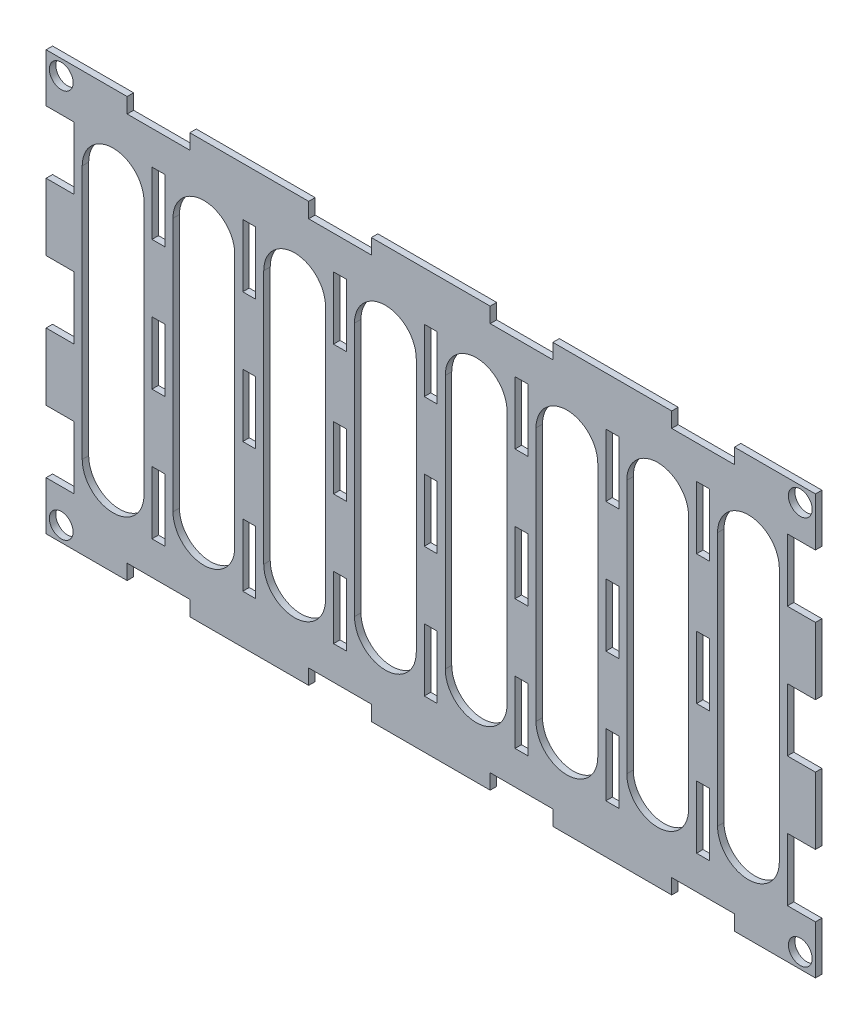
from build123d import *

# Parameters (mm, degrees)
SKETCH1_W           = 6
SKETCH1_H           = 29
BOSS_EXTRUDE1_DEPTH = 3
SKETCH2_R           = 5.5
CUT_EXTRUDE1_DEPTH  = 10


with BuildPart() as part:
    # Sketch1 → Boss-Extrude1 (new body)
    with BuildSketch(Plane.XY):
        Polygon((0, 22.5), (0, 0), (37.5, 0), (37.5, 7), (66.5, 7), (66.5, 0), (121.5, 0), (121.5, 7), (150.5, 7), (150.5, 0), (205.5, 0), (205.5, 7), (234.5, 7), (234.5, 0), (289.5, 0), (289.5, 7), (318.5, 7), (318.5, 0), (356, 0), (356, 22.5), (349, 22.5), (343, 22.5), (343, 51.5), (349, 51.5), (356, 51.5), (356, 82.5), (349, 82.5), (343, 82.5), (343, 97), (343, 111.5), (349, 111.5), (356, 111.5), (356, 142.5), (349, 142.5), (343, 142.5), (343, 171.5), (349, 171.5), (356, 171.5), (356, 194), (318.5, 194), (318.5, 187), (289.5, 187), (289.5, 194), (234.5, 194), (234.5, 187), (205.5, 187), (205.5, 194), (150.5, 194), (150.5, 187), (121.5, 187), (121.5, 194), (66.5, 194), (66.5, 187), (37.5, 187), (37.5, 194), (0, 194), (0, 171.5), (7, 171.5), (13, 171.5), (13, 142.5), (7, 142.5), (0, 142.5), (0, 111.5), (7, 111.5), (13, 111.5), (13, 82.5), (7, 82.5), (0, 82.5), (0, 51.5), (7, 51.5), (13, 51.5), (13, 22.5), (7, 22.5), align=None)
        with Locations((52, 37)):
            Rectangle(SKETCH1_W, SKETCH1_H, mode=Mode.SUBTRACT)
        with Locations((94, 37)):
            Rectangle(SKETCH1_W, SKETCH1_H, mode=Mode.SUBTRACT)
        with Locations((136, 37)):
            Rectangle(SKETCH1_W, SKETCH1_H, mode=Mode.SUBTRACT)
        with Locations((178, 37)):
            Rectangle(SKETCH1_W, SKETCH1_H, mode=Mode.SUBTRACT)
        with Locations((220, 37)):
            Rectangle(SKETCH1_W, SKETCH1_H, mode=Mode.SUBTRACT)
        with Locations((262, 37)):
            Rectangle(SKETCH1_W, SKETCH1_H, mode=Mode.SUBTRACT)
        with Locations((304, 37)):
            Rectangle(SKETCH1_W, SKETCH1_H, mode=Mode.SUBTRACT)
        with BuildLine():
            ThreePointArc((268.71, 155.82), (283, 170.11), (297.29, 155.82))
            Line((297.29, 155.82), (297.29, 38.18))
            ThreePointArc((297.29, 38.18), (283, 23.89), (268.71, 38.18))
            Line((268.71, 38.18), (268.71, 155.82))
        make_face(mode=Mode.SUBTRACT)
        with BuildLine():
            ThreePointArc((16.71, 155.82), (31, 170.11), (45.29, 155.82))
            Line((45.29, 155.82), (45.29, 38.18))
            ThreePointArc((45.29, 38.18), (31, 23.89), (16.71, 38.18))
            Line((16.71, 38.18), (16.71, 155.82))
        make_face(mode=Mode.SUBTRACT)
        Polygon((55, 111.5), (55, 82.5), (49, 82.5), (49, 97), (49, 111.5), align=None, mode=Mode.SUBTRACT)
        with BuildLine():
            ThreePointArc((58.71, 155.82), (73, 170.11), (87.29, 155.82))
            Line((87.29, 155.82), (87.29, 38.18))
            ThreePointArc((87.29, 38.18), (73, 23.89), (58.71, 38.18))
            Line((58.71, 38.18), (58.71, 155.82))
        make_face(mode=Mode.SUBTRACT)
        Polygon((97, 111.5), (97, 82.5), (91, 82.5), (91, 97), (91, 111.5), align=None, mode=Mode.SUBTRACT)
        with BuildLine():
            ThreePointArc((100.71, 155.82), (115, 170.11), (129.29, 155.82))
            Line((129.29, 155.82), (129.29, 38.18))
            ThreePointArc((129.29, 38.18), (115, 23.89), (100.71, 38.18))
            Line((100.71, 38.18), (100.71, 155.82))
        make_face(mode=Mode.SUBTRACT)
        Polygon((139, 111.5), (139, 82.5), (133, 82.5), (133, 97), (133, 111.5), align=None, mode=Mode.SUBTRACT)
        with BuildLine():
            ThreePointArc((142.71, 155.82), (157, 170.11), (171.29, 155.82))
            Line((171.29, 155.82), (171.29, 38.18))
            ThreePointArc((171.29, 38.18), (157, 23.89), (142.71, 38.18))
            Line((142.71, 38.18), (142.71, 155.82))
        make_face(mode=Mode.SUBTRACT)
        Polygon((181, 111.5), (181, 82.5), (175, 82.5), (175, 97), (175, 111.5), align=None, mode=Mode.SUBTRACT)
        with Locations((52, 157)):
            Rectangle(SKETCH1_W, SKETCH1_H, mode=Mode.SUBTRACT)
        with Locations((94, 157)):
            Rectangle(SKETCH1_W, SKETCH1_H, mode=Mode.SUBTRACT)
        with Locations((136, 157)):
            Rectangle(SKETCH1_W, SKETCH1_H, mode=Mode.SUBTRACT)
        with Locations((178, 157)):
            Rectangle(SKETCH1_W, SKETCH1_H, mode=Mode.SUBTRACT)
        with BuildLine():
            ThreePointArc((184.71, 155.82), (199, 170.11), (213.29, 155.82))
            Line((213.29, 155.82), (213.29, 38.18))
            ThreePointArc((213.29, 38.18), (199, 23.89), (184.71, 38.18))
            Line((184.71, 38.18), (184.71, 155.82))
        make_face(mode=Mode.SUBTRACT)
        Polygon((223, 111.5), (223, 82.5), (217, 82.5), (217, 97), (217, 111.5), align=None, mode=Mode.SUBTRACT)
        with BuildLine():
            ThreePointArc((226.71, 155.82), (241, 170.11), (255.29, 155.82))
            Line((255.29, 155.82), (255.29, 38.18))
            ThreePointArc((255.29, 38.18), (241, 23.89), (226.71, 38.18))
            Line((226.71, 38.18), (226.71, 155.82))
        make_face(mode=Mode.SUBTRACT)
        Polygon((265, 111.5), (265, 82.5), (259, 82.5), (259, 97), (259, 111.5), align=None, mode=Mode.SUBTRACT)
        Polygon((307, 111.5), (307, 82.5), (301, 82.5), (301, 97), (301, 111.5), align=None, mode=Mode.SUBTRACT)
        with BuildLine():
            ThreePointArc((310.71, 155.82), (325, 170.11), (339.29, 155.82))
            Line((339.29, 155.82), (339.29, 38.18))
            ThreePointArc((339.29, 38.18), (325, 23.89), (310.71, 38.18))
            Line((310.71, 38.18), (310.71, 155.82))
        make_face(mode=Mode.SUBTRACT)
        with Locations((220, 157)):
            Rectangle(SKETCH1_W, SKETCH1_H, mode=Mode.SUBTRACT)
        with Locations((262, 157)):
            Rectangle(SKETCH1_W, SKETCH1_H, mode=Mode.SUBTRACT)
        with Locations((304, 157)):
            Rectangle(SKETCH1_W, SKETCH1_H, mode=Mode.SUBTRACT)
    extrude(amount=BOSS_EXTRUDE1_DEPTH)

    # Sketch2 → Cut-Extrude1 (cut)
    with BuildSketch(Plane.XY.offset(3)):
        with Locations((7, 187)):
            Circle(SKETCH2_R)
        with Locations((349, 187)):
            Circle(SKETCH2_R)
        with Locations((349, 7)):
            Circle(SKETCH2_R)
        with Locations((7, 7)):
            Circle(SKETCH2_R)
    extrude(amount=-CUT_EXTRUDE1_DEPTH, mode=Mode.SUBTRACT)


solid = part.part
